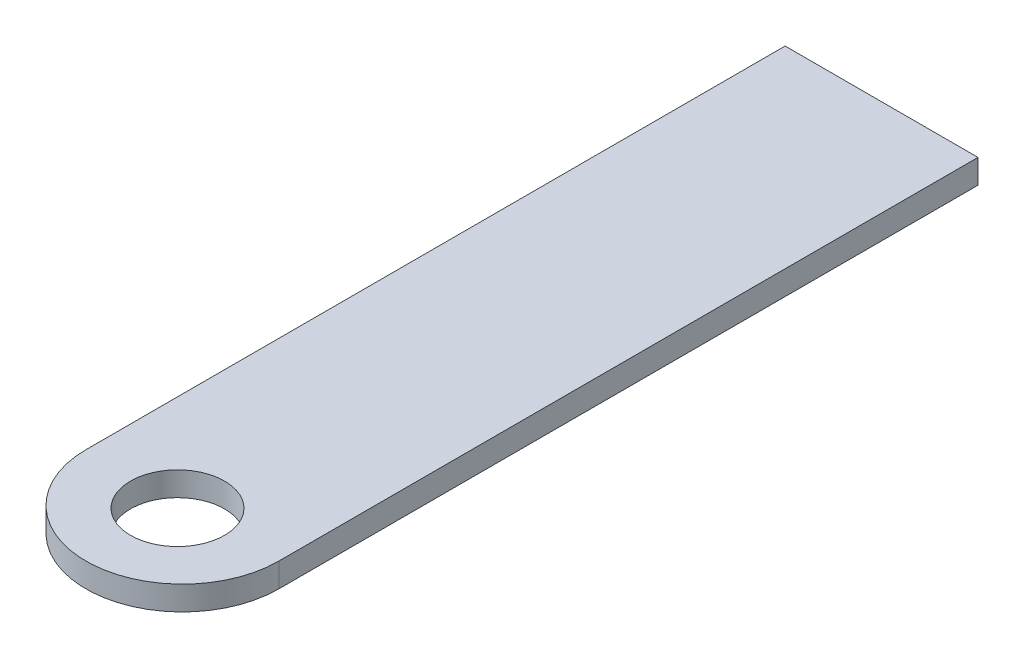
ISO-10303-21;
HEADER;
FILE_DESCRIPTION(('STEP AP214'),'2;1');
FILE_NAME('part.step','',(''),(''),'','','');
FILE_SCHEMA(('AUTOMOTIVE_DESIGN { 1 0 10303 214 1 1 1 1 }'));
ENDSEC;
DATA;
#1=APPLICATION_CONTEXT('core data for automotive mechanical design processes');
#2=APPLICATION_PROTOCOL_DEFINITION('international standard','automotive_design',2000,#1);
#3=PRODUCT_CONTEXT('',#1,'mechanical');
#4=PRODUCT('Part','Part','',(#3));
#5=PRODUCT_RELATED_PRODUCT_CATEGORY('part','',(#4));
#6=PRODUCT_DEFINITION_FORMATION('','',#4);
#7=PRODUCT_DEFINITION_CONTEXT('part definition',#1,'design');
#8=PRODUCT_DEFINITION('design','',#6,#7);
#9=PRODUCT_DEFINITION_SHAPE('','',#8);
#10=(LENGTH_UNIT() NAMED_UNIT(*) SI_UNIT(.MILLI.,.METRE.));
#11=(NAMED_UNIT(*) PLANE_ANGLE_UNIT() SI_UNIT($,.RADIAN.));
#12=(NAMED_UNIT(*) SI_UNIT($,.STERADIAN.) SOLID_ANGLE_UNIT());
#13=UNCERTAINTY_MEASURE_WITH_UNIT(LENGTH_MEASURE(1.E-05),#10,'distance_accuracy_value','');
#14=(GEOMETRIC_REPRESENTATION_CONTEXT(3) GLOBAL_UNCERTAINTY_ASSIGNED_CONTEXT((#13)) GLOBAL_UNIT_ASSIGNED_CONTEXT((#10,
#11,#12)) REPRESENTATION_CONTEXT('',''));
#15=CARTESIAN_POINT('',(0.,0.,0.));
#16=DIRECTION('',(0.,0.,1.));
#17=DIRECTION('',(1.,0.,0.));
#18=AXIS2_PLACEMENT_3D('',#15,#16,#17);
#19=CARTESIAN_POINT('',(-20.,-5.,-82.5));
#20=DIRECTION('',(-1.,0.,0.));
#21=DIRECTION('',(0.,0.,1.));
#22=AXIS2_PLACEMENT_3D('',#19,#20,#21);
#23=PLANE('',#22);
#24=DIRECTION('',(0.,0.,1.));
#25=VECTOR('',#24,1.);
#26=CARTESIAN_POINT('',(-20.,0.,-82.5));
#27=LINE('',#26,#25);
#28=CARTESIAN_POINT('',(-20.,0.,-82.5));
#29=VERTEX_POINT('',#28);
#30=CARTESIAN_POINT('',(-20.,0.,62.5));
#31=VERTEX_POINT('',#30);
#32=EDGE_CURVE('E105',#29,#31,#27,.T.);
#33=ORIENTED_EDGE('',*,*,#32,.F.);
#34=DIRECTION('',(0.,1.,0.));
#35=VECTOR('',#34,1.);
#36=CARTESIAN_POINT('',(-20.,-5.,-82.5));
#37=LINE('',#36,#35);
#38=CARTESIAN_POINT('',(-20.,-5.,-82.5));
#39=VERTEX_POINT('',#38);
#40=EDGE_CURVE('E11',#39,#29,#37,.T.);
#41=ORIENTED_EDGE('',*,*,#40,.F.);
#42=DIRECTION('',(0.,0.,1.));
#43=VECTOR('',#42,1.);
#44=CARTESIAN_POINT('',(-20.,-5.,-82.5));
#45=LINE('',#44,#43);
#46=CARTESIAN_POINT('',(-20.,-5.,62.5));
#47=VERTEX_POINT('',#46);
#48=EDGE_CURVE('E98',#39,#47,#45,.T.);
#49=ORIENTED_EDGE('',*,*,#48,.T.);
#50=DIRECTION('',(0.,1.,0.));
#51=VECTOR('',#50,1.);
#52=CARTESIAN_POINT('',(-20.,-5.,62.5));
#53=LINE('',#52,#51);
#54=EDGE_CURVE('E43',#47,#31,#53,.T.);
#55=ORIENTED_EDGE('',*,*,#54,.T.);
#56=EDGE_LOOP('',(#33,#41,#49,#55));
#57=FACE_BOUND('',#56,.T.);
#58=ADVANCED_FACE('F40',(#57),#23,.T.);
#59=CARTESIAN_POINT('',(-20.,-5.,-82.5));
#60=DIRECTION('',(0.,0.,-1.));
#61=DIRECTION('',(-1.,0.,0.));
#62=AXIS2_PLACEMENT_3D('',#59,#60,#61);
#63=PLANE('',#62);
#64=DIRECTION('',(-1.,0.,0.));
#65=VECTOR('',#64,1.);
#66=CARTESIAN_POINT('',(-20.,0.,-82.5));
#67=LINE('',#66,#65);
#68=CARTESIAN_POINT('',(20.,0.,-82.5));
#69=VERTEX_POINT('',#68);
#70=EDGE_CURVE('E100',#69,#29,#67,.T.);
#71=ORIENTED_EDGE('',*,*,#70,.F.);
#72=DIRECTION('',(0.,1.,0.));
#73=VECTOR('',#72,1.);
#74=CARTESIAN_POINT('',(20.,-5.,-82.5));
#75=LINE('',#74,#73);
#76=CARTESIAN_POINT('',(20.,-5.,-82.5));
#77=VERTEX_POINT('',#76);
#78=EDGE_CURVE('E49',#77,#69,#75,.T.);
#79=ORIENTED_EDGE('',*,*,#78,.F.);
#80=DIRECTION('',(-1.,0.,0.));
#81=VECTOR('',#80,1.);
#82=CARTESIAN_POINT('',(-20.,-5.,-82.5));
#83=LINE('',#82,#81);
#84=EDGE_CURVE('E95',#77,#39,#83,.T.);
#85=ORIENTED_EDGE('',*,*,#84,.T.);
#86=ORIENTED_EDGE('',*,*,#40,.T.);
#87=EDGE_LOOP('',(#71,#79,#85,#86));
#88=FACE_BOUND('',#87,.T.);
#89=ADVANCED_FACE('F116',(#88),#63,.T.);
#90=CARTESIAN_POINT('',(20.,-5.,-82.5));
#91=DIRECTION('',(1.,0.,0.));
#92=DIRECTION('',(0.,0.,-1.));
#93=AXIS2_PLACEMENT_3D('',#90,#91,#92);
#94=PLANE('',#93);
#95=DIRECTION('',(0.,0.,-1.));
#96=VECTOR('',#95,1.);
#97=CARTESIAN_POINT('',(20.,0.,-82.5));
#98=LINE('',#97,#96);
#99=CARTESIAN_POINT('',(20.,0.,62.5));
#100=VERTEX_POINT('',#99);
#101=EDGE_CURVE('E90',#100,#69,#98,.T.);
#102=ORIENTED_EDGE('',*,*,#101,.F.);
#103=DIRECTION('',(0.,1.,0.));
#104=VECTOR('',#103,1.);
#105=CARTESIAN_POINT('',(20.,-5.,62.5));
#106=LINE('',#105,#104);
#107=CARTESIAN_POINT('',(20.,-5.,62.5));
#108=VERTEX_POINT('',#107);
#109=EDGE_CURVE('E85',#108,#100,#106,.T.);
#110=ORIENTED_EDGE('',*,*,#109,.F.);
#111=DIRECTION('',(0.,0.,-1.));
#112=VECTOR('',#111,1.);
#113=CARTESIAN_POINT('',(20.,-5.,-82.5));
#114=LINE('',#113,#112);
#115=EDGE_CURVE('E88',#108,#77,#114,.T.);
#116=ORIENTED_EDGE('',*,*,#115,.T.);
#117=ORIENTED_EDGE('',*,*,#78,.T.);
#118=EDGE_LOOP('',(#102,#110,#116,#117));
#119=FACE_BOUND('',#118,.T.);
#120=ADVANCED_FACE('F87',(#119),#94,.T.);
#121=CARTESIAN_POINT('',(0.,-5.,62.5));
#122=DIRECTION('',(0.,1.,0.));
#123=DIRECTION('',(0.,0.,1.));
#124=AXIS2_PLACEMENT_3D('',#121,#122,#123);
#125=CYLINDRICAL_SURFACE('',#124,20.);
#126=CARTESIAN_POINT('',(0.,0.,62.5));
#127=DIRECTION('',(0.,1.,0.));
#128=DIRECTION('',(0.,0.,1.));
#129=AXIS2_PLACEMENT_3D('',#126,#127,#128);
#130=CIRCLE('',#129,20.);
#131=EDGE_CURVE('E108',#31,#100,#130,.T.);
#132=ORIENTED_EDGE('',*,*,#131,.F.);
#133=ORIENTED_EDGE('',*,*,#54,.F.);
#134=CARTESIAN_POINT('',(0.,-5.,62.5));
#135=DIRECTION('',(0.,1.,0.));
#136=DIRECTION('',(0.,0.,1.));
#137=AXIS2_PLACEMENT_3D('',#134,#135,#136);
#138=CIRCLE('',#137,20.);
#139=EDGE_CURVE('E94',#47,#108,#138,.T.);
#140=ORIENTED_EDGE('',*,*,#139,.T.);
#141=ORIENTED_EDGE('',*,*,#109,.T.);
#142=EDGE_LOOP('',(#132,#133,#140,#141));
#143=FACE_BOUND('',#142,.T.);
#144=ADVANCED_FACE('F97',(#143),#125,.T.);
#145=CARTESIAN_POINT('',(0.,-5.,62.5));
#146=DIRECTION('',(0.,1.,0.));
#147=DIRECTION('',(0.,0.,1.));
#148=AXIS2_PLACEMENT_3D('',#145,#146,#147);
#149=PLANE('',#148);
#150=CARTESIAN_POINT('',(0.,-5.,63.5));
#151=DIRECTION('',(0.,1.,0.));
#152=DIRECTION('',(0.,0.,1.));
#153=AXIS2_PLACEMENT_3D('',#150,#151,#152);
#154=CIRCLE('',#153,9.75);
#155=CARTESIAN_POINT('',(0.,-5.,73.25));
#156=VERTEX_POINT('',#155);
#157=EDGE_CURVE('E109',#156,#156,#154,.T.);
#158=ORIENTED_EDGE('',*,*,#157,.T.);
#159=EDGE_LOOP('',(#158));
#160=FACE_BOUND('',#159,.T.);
#161=ORIENTED_EDGE('',*,*,#48,.F.);
#162=ORIENTED_EDGE('',*,*,#84,.F.);
#163=ORIENTED_EDGE('',*,*,#115,.F.);
#164=ORIENTED_EDGE('',*,*,#139,.F.);
#165=EDGE_LOOP('',(#161,#162,#163,#164));
#166=FACE_BOUND('',#165,.T.);
#167=ADVANCED_FACE('F93',(#160,#166),#149,.F.);
#168=CARTESIAN_POINT('',(0.,0.,62.5));
#169=DIRECTION('',(0.,1.,0.));
#170=DIRECTION('',(0.,0.,1.));
#171=AXIS2_PLACEMENT_3D('',#168,#169,#170);
#172=PLANE('',#171);
#173=CARTESIAN_POINT('',(0.,0.,63.5));
#174=DIRECTION('',(0.,1.,0.));
#175=DIRECTION('',(0.,0.,1.));
#176=AXIS2_PLACEMENT_3D('',#173,#174,#175);
#177=CIRCLE('',#176,9.75);
#178=CARTESIAN_POINT('',(0.,0.,73.25));
#179=VERTEX_POINT('',#178);
#180=EDGE_CURVE('E146',#179,#179,#177,.T.);
#181=ORIENTED_EDGE('',*,*,#180,.F.);
#182=EDGE_LOOP('',(#181));
#183=FACE_BOUND('',#182,.T.);
#184=ORIENTED_EDGE('',*,*,#32,.T.);
#185=ORIENTED_EDGE('',*,*,#131,.T.);
#186=ORIENTED_EDGE('',*,*,#101,.T.);
#187=ORIENTED_EDGE('',*,*,#70,.T.);
#188=EDGE_LOOP('',(#184,#185,#186,#187));
#189=FACE_BOUND('',#188,.T.);
#190=ADVANCED_FACE('F115',(#183,#189),#172,.T.);
#191=CARTESIAN_POINT('',(0.,-5.,63.5));
#192=DIRECTION('',(0.,1.,0.));
#193=DIRECTION('',(0.,0.,1.));
#194=AXIS2_PLACEMENT_3D('',#191,#192,#193);
#195=CYLINDRICAL_SURFACE('',#194,9.75);
#196=ORIENTED_EDGE('',*,*,#157,.F.);
#197=EDGE_LOOP('',(#196));
#198=FACE_BOUND('',#197,.T.);
#199=ORIENTED_EDGE('',*,*,#180,.T.);
#200=EDGE_LOOP('',(#199));
#201=FACE_BOUND('',#200,.T.);
#202=ADVANCED_FACE('F134',(#198,#201),#195,.F.);
#203=CLOSED_SHELL('',(#58,#89,#120,#144,#167,#190,#202));
#204=MANIFOLD_SOLID_BREP('B2',#203);
#205=ADVANCED_BREP_SHAPE_REPRESENTATION('',(#18,#204),#14);
#206=SHAPE_DEFINITION_REPRESENTATION(#9,#205);
ENDSEC;
END-ISO-10303-21;
